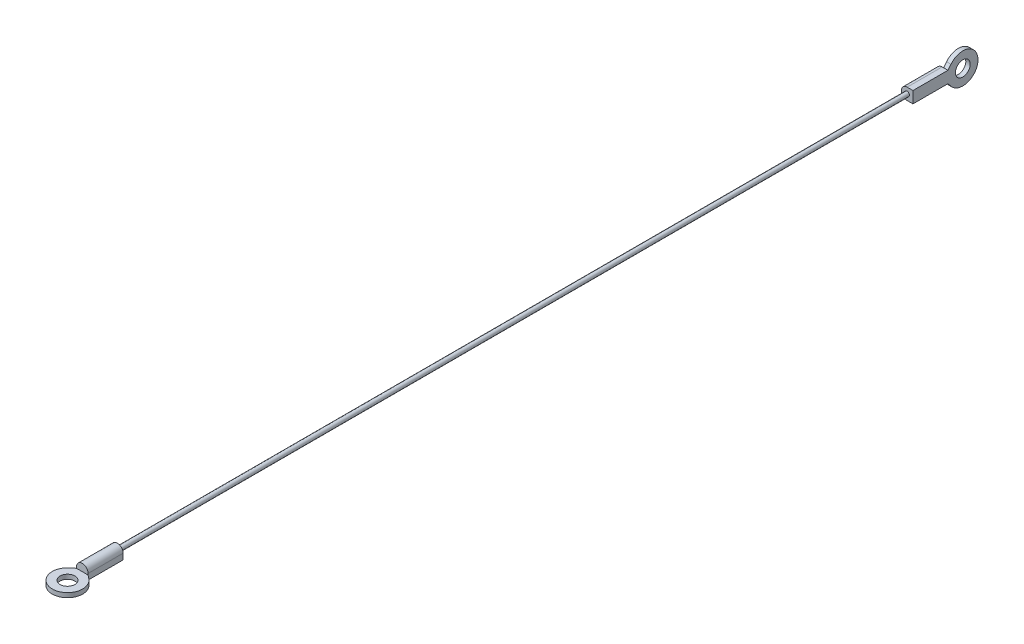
ISO-10303-21;
HEADER;
FILE_DESCRIPTION(('STEP AP214'),'2;1');
FILE_NAME('part.step','',(''),(''),'','','');
FILE_SCHEMA(('AUTOMOTIVE_DESIGN { 1 0 10303 214 1 1 1 1 }'));
ENDSEC;
DATA;
#1=APPLICATION_CONTEXT('core data for automotive mechanical design processes');
#2=APPLICATION_PROTOCOL_DEFINITION('international standard','automotive_design',2000,#1);
#3=PRODUCT_CONTEXT('',#1,'mechanical');
#4=PRODUCT('Part','Part','',(#3));
#5=PRODUCT_RELATED_PRODUCT_CATEGORY('part','',(#4));
#6=PRODUCT_DEFINITION_FORMATION('','',#4);
#7=PRODUCT_DEFINITION_CONTEXT('part definition',#1,'design');
#8=PRODUCT_DEFINITION('design','',#6,#7);
#9=PRODUCT_DEFINITION_SHAPE('','',#8);
#10=(LENGTH_UNIT() NAMED_UNIT(*) SI_UNIT(.MILLI.,.METRE.));
#11=(NAMED_UNIT(*) PLANE_ANGLE_UNIT() SI_UNIT($,.RADIAN.));
#12=(NAMED_UNIT(*) SI_UNIT($,.STERADIAN.) SOLID_ANGLE_UNIT());
#13=UNCERTAINTY_MEASURE_WITH_UNIT(LENGTH_MEASURE(1.E-05),#10,'distance_accuracy_value','');
#14=(GEOMETRIC_REPRESENTATION_CONTEXT(3) GLOBAL_UNCERTAINTY_ASSIGNED_CONTEXT((#13)) GLOBAL_UNIT_ASSIGNED_CONTEXT((#10,
#11,#12)) REPRESENTATION_CONTEXT('',''));
#15=CARTESIAN_POINT('',(0.,0.,0.));
#16=DIRECTION('',(0.,0.,1.));
#17=DIRECTION('',(1.,0.,0.));
#18=AXIS2_PLACEMENT_3D('',#15,#16,#17);
#19=CARTESIAN_POINT('',(0.,0.,-147.32));
#20=DIRECTION('',(0.,0.,-1.));
#21=DIRECTION('',(-1.,0.,0.));
#22=AXIS2_PLACEMENT_3D('',#19,#20,#21);
#23=PLANE('',#22);
#24=DIRECTION('',(1.,0.,0.));
#25=VECTOR('',#24,1.);
#26=CARTESIAN_POINT('',(0.,1.99,-147.32));
#27=LINE('',#26,#25);
#28=CARTESIAN_POINT('',(0.,1.99,-147.32));
#29=VERTEX_POINT('',#28);
#30=CARTESIAN_POINT('',(0.47,1.99,-147.32));
#31=VERTEX_POINT('',#30);
#32=EDGE_CURVE('E196',#29,#31,#27,.T.);
#33=ORIENTED_EDGE('',*,*,#32,.T.);
#34=DIRECTION('',(0.,-1.,0.));
#35=VECTOR('',#34,1.);
#36=CARTESIAN_POINT('',(0.47,-1.99,-147.32));
#37=LINE('',#36,#35);
#38=CARTESIAN_POINT('',(0.47,-1.99,-147.32));
#39=VERTEX_POINT('',#38);
#40=EDGE_CURVE('E154',#31,#39,#37,.T.);
#41=ORIENTED_EDGE('',*,*,#40,.T.);
#42=DIRECTION('',(-1.,0.,0.));
#43=VECTOR('',#42,1.);
#44=CARTESIAN_POINT('',(1.99,-1.99,-147.32));
#45=LINE('',#44,#43);
#46=CARTESIAN_POINT('',(0.,-1.99,-147.32));
#47=VERTEX_POINT('',#46);
#48=EDGE_CURVE('E201',#39,#47,#45,.T.);
#49=ORIENTED_EDGE('',*,*,#48,.T.);
#50=CARTESIAN_POINT('',(0.,0.,-147.32));
#51=DIRECTION('',(0.,0.,-1.));
#52=DIRECTION('',(-1.,0.,0.));
#53=AXIS2_PLACEMENT_3D('',#50,#51,#52);
#54=CIRCLE('',#53,1.99);
#55=EDGE_CURVE('E192',#47,#29,#54,.T.);
#56=ORIENTED_EDGE('',*,*,#55,.T.);
#57=EDGE_LOOP('',(#33,#41,#49,#56));
#58=FACE_BOUND('',#57,.T.);
#59=ADVANCED_FACE('F39',(#58),#23,.T.);
#60=CARTESIAN_POINT('',(0.,0.,147.32));
#61=DIRECTION('',(0.,0.,1.));
#62=DIRECTION('',(1.,0.,0.));
#63=AXIS2_PLACEMENT_3D('',#60,#61,#62);
#64=PLANE('',#63);
#65=DIRECTION('',(0.,-1.,0.));
#66=VECTOR('',#65,1.);
#67=CARTESIAN_POINT('',(-1.99,0.,147.32));
#68=LINE('',#67,#66);
#69=CARTESIAN_POINT('',(-1.99,0.,147.32));
#70=VERTEX_POINT('',#69);
#71=CARTESIAN_POINT('',(-1.99,-0.47,147.32));
#72=VERTEX_POINT('',#71);
#73=EDGE_CURVE('E280',#70,#72,#68,.T.);
#74=ORIENTED_EDGE('',*,*,#73,.T.);
#75=DIRECTION('',(1.,0.,0.));
#76=VECTOR('',#75,1.);
#77=CARTESIAN_POINT('',(-1.99,-0.47,147.32));
#78=LINE('',#77,#76);
#79=CARTESIAN_POINT('',(1.99,-0.47,147.32));
#80=VERTEX_POINT('',#79);
#81=EDGE_CURVE('E241',#72,#80,#78,.T.);
#82=ORIENTED_EDGE('',*,*,#81,.T.);
#83=DIRECTION('',(0.,1.,0.));
#84=VECTOR('',#83,1.);
#85=CARTESIAN_POINT('',(1.99,-1.99,147.32));
#86=LINE('',#85,#84);
#87=CARTESIAN_POINT('',(1.99,0.,147.32));
#88=VERTEX_POINT('',#87);
#89=EDGE_CURVE('E285',#80,#88,#86,.T.);
#90=ORIENTED_EDGE('',*,*,#89,.T.);
#91=CARTESIAN_POINT('',(0.,0.,147.32));
#92=DIRECTION('',(0.,0.,1.));
#93=DIRECTION('',(1.,0.,0.));
#94=AXIS2_PLACEMENT_3D('',#91,#92,#93);
#95=CIRCLE('',#94,1.99);
#96=EDGE_CURVE('E276',#88,#70,#95,.T.);
#97=ORIENTED_EDGE('',*,*,#96,.T.);
#98=EDGE_LOOP('',(#74,#82,#90,#97));
#99=FACE_BOUND('',#98,.T.);
#100=ADVANCED_FACE('F338',(#99),#64,.T.);
#101=CARTESIAN_POINT('',(0.,0.,135.32));
#102=DIRECTION('',(0.,0.,-1.));
#103=DIRECTION('',(-1.,0.,0.));
#104=AXIS2_PLACEMENT_3D('',#101,#102,#103);
#105=CYLINDRICAL_SURFACE('',#104,0.795);
#106=CARTESIAN_POINT('',(0.,0.,135.32));
#107=DIRECTION('',(0.,0.,1.));
#108=DIRECTION('',(1.,0.,0.));
#109=AXIS2_PLACEMENT_3D('',#106,#107,#108);
#110=CIRCLE('',#109,0.795);
#111=CARTESIAN_POINT('',(0.795,0.,135.32));
#112=VERTEX_POINT('',#111);
#113=EDGE_CURVE('E11',#112,#112,#110,.T.);
#114=ORIENTED_EDGE('',*,*,#113,.F.);
#115=EDGE_LOOP('',(#114));
#116=FACE_BOUND('',#115,.T.);
#117=CARTESIAN_POINT('',(0.,0.,-135.32));
#118=DIRECTION('',(0.,0.,1.));
#119=DIRECTION('',(1.,0.,0.));
#120=AXIS2_PLACEMENT_3D('',#117,#118,#119);
#121=CIRCLE('',#120,0.795);
#122=CARTESIAN_POINT('',(0.795,0.,-135.32));
#123=VERTEX_POINT('',#122);
#124=EDGE_CURVE('E43',#123,#123,#121,.T.);
#125=ORIENTED_EDGE('',*,*,#124,.T.);
#126=EDGE_LOOP('',(#125));
#127=FACE_BOUND('',#126,.T.);
#128=ADVANCED_FACE('F41',(#116,#127),#105,.T.);
#129=CARTESIAN_POINT('',(0.,0.,147.32));
#130=DIRECTION('',(0.,0.,-1.));
#131=DIRECTION('',(-1.,0.,0.));
#132=AXIS2_PLACEMENT_3D('',#129,#130,#131);
#133=CYLINDRICAL_SURFACE('',#132,1.99);
#134=CARTESIAN_POINT('',(0.,0.,135.32));
#135=DIRECTION('',(0.,0.,1.));
#136=DIRECTION('',(1.,0.,0.));
#137=AXIS2_PLACEMENT_3D('',#134,#135,#136);
#138=CIRCLE('',#137,1.99);
#139=CARTESIAN_POINT('',(1.99,0.,135.32));
#140=VERTEX_POINT('',#139);
#141=CARTESIAN_POINT('',(-1.99,0.,135.32));
#142=VERTEX_POINT('',#141);
#143=EDGE_CURVE('E270',#140,#142,#138,.T.);
#144=ORIENTED_EDGE('',*,*,#143,.T.);
#145=DIRECTION('',(0.,0.,-1.));
#146=VECTOR('',#145,1.);
#147=CARTESIAN_POINT('',(-1.99,0.,147.32));
#148=LINE('',#147,#146);
#149=EDGE_CURVE('E49',#70,#142,#148,.T.);
#150=ORIENTED_EDGE('',*,*,#149,.F.);
#151=ORIENTED_EDGE('',*,*,#96,.F.);
#152=DIRECTION('',(0.,0.,-1.));
#153=VECTOR('',#152,1.);
#154=CARTESIAN_POINT('',(1.99,0.,147.32));
#155=LINE('',#154,#153);
#156=EDGE_CURVE('E289',#88,#140,#155,.T.);
#157=ORIENTED_EDGE('',*,*,#156,.T.);
#158=EDGE_LOOP('',(#144,#150,#151,#157));
#159=FACE_BOUND('',#158,.T.);
#160=ADVANCED_FACE('F322',(#159),#133,.T.);
#161=CARTESIAN_POINT('',(-1.99,0.,147.32));
#162=DIRECTION('',(1.,0.,0.));
#163=DIRECTION('',(0.,1.,0.));
#164=AXIS2_PLACEMENT_3D('',#161,#162,#163);
#165=PLANE('',#164);
#166=DIRECTION('',(0.,-1.,0.));
#167=VECTOR('',#166,1.);
#168=CARTESIAN_POINT('',(-1.99,0.,135.32));
#169=LINE('',#168,#167);
#170=CARTESIAN_POINT('',(-1.99,-1.99,135.32));
#171=VERTEX_POINT('',#170);
#172=EDGE_CURVE('E293',#142,#171,#169,.T.);
#173=ORIENTED_EDGE('',*,*,#172,.T.);
#174=DIRECTION('',(0.,0.,-1.));
#175=VECTOR('',#174,1.);
#176=CARTESIAN_POINT('',(-1.99,-1.99,147.32));
#177=LINE('',#176,#175);
#178=CARTESIAN_POINT('',(-1.99,-1.99,147.32));
#179=VERTEX_POINT('',#178);
#180=EDGE_CURVE('E308',#179,#171,#177,.T.);
#181=ORIENTED_EDGE('',*,*,#180,.F.);
#182=DIRECTION('',(0.,-1.,0.));
#183=VECTOR('',#182,1.);
#184=CARTESIAN_POINT('',(-1.99,-0.47,147.32));
#185=LINE('',#184,#183);
#186=EDGE_CURVE('E267',#72,#179,#185,.T.);
#187=ORIENTED_EDGE('',*,*,#186,.F.);
#188=ORIENTED_EDGE('',*,*,#73,.F.);
#189=ORIENTED_EDGE('',*,*,#149,.T.);
#190=EDGE_LOOP('',(#173,#181,#187,#188,#189));
#191=FACE_BOUND('',#190,.T.);
#192=ADVANCED_FACE('F316',(#191),#165,.F.);
#193=CARTESIAN_POINT('',(0.,-1.99,147.32));
#194=DIRECTION('',(0.,1.,0.));
#195=DIRECTION('',(0.,0.,1.));
#196=AXIS2_PLACEMENT_3D('',#193,#194,#195);
#197=PLANE('',#196);
#198=DIRECTION('',(1.,0.,0.));
#199=VECTOR('',#198,1.);
#200=CARTESIAN_POINT('',(0.,-1.99,135.32));
#201=LINE('',#200,#199);
#202=CARTESIAN_POINT('',(1.99,-1.99,135.32));
#203=VERTEX_POINT('',#202);
#204=EDGE_CURVE('E297',#171,#203,#201,.T.);
#205=ORIENTED_EDGE('',*,*,#204,.T.);
#206=DIRECTION('',(0.,0.,-1.));
#207=VECTOR('',#206,1.);
#208=CARTESIAN_POINT('',(1.99,-1.99,147.32));
#209=LINE('',#208,#207);
#210=CARTESIAN_POINT('',(1.99,-1.99,147.32));
#211=VERTEX_POINT('',#210);
#212=EDGE_CURVE('E304',#211,#203,#209,.T.);
#213=ORIENTED_EDGE('',*,*,#212,.F.);
#214=DIRECTION('',(0.778962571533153,0.,0.627070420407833));
#215=VECTOR('',#214,1.);
#216=CARTESIAN_POINT('',(1.99,-1.99,147.32));
#217=LINE('',#216,#215);
#218=CARTESIAN_POINT('',(3.26390153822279,-1.99,148.34549981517));
#219=VERTEX_POINT('',#218);
#220=EDGE_CURVE('E236',#211,#219,#217,.T.);
#221=ORIENTED_EDGE('',*,*,#220,.T.);
#222=CARTESIAN_POINT('',(0.,-1.99,152.4));
#223=DIRECTION('',(0.,-1.,0.));
#224=DIRECTION('',(0.,0.,-1.));
#225=AXIS2_PLACEMENT_3D('',#222,#223,#224);
#226=CIRCLE('',#225,5.20500000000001);
#227=CARTESIAN_POINT('',(-3.2639015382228,-1.99,148.34549981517));
#228=VERTEX_POINT('',#227);
#229=EDGE_CURVE('E260',#219,#228,#226,.T.);
#230=ORIENTED_EDGE('',*,*,#229,.T.);
#231=DIRECTION('',(0.778962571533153,0.,-0.627070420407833));
#232=VECTOR('',#231,1.);
#233=CARTESIAN_POINT('',(-3.26390153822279,-1.99,148.34549981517));
#234=LINE('',#233,#232);
#235=EDGE_CURVE('E245',#228,#179,#234,.T.);
#236=ORIENTED_EDGE('',*,*,#235,.T.);
#237=ORIENTED_EDGE('',*,*,#180,.T.);
#238=EDGE_LOOP('',(#205,#213,#221,#230,#236,#237));
#239=FACE_BOUND('',#238,.T.);
#240=CARTESIAN_POINT('',(0.,-1.99,152.4));
#241=DIRECTION('',(0.,-1.,0.));
#242=DIRECTION('',(0.,0.,-1.));
#243=AXIS2_PLACEMENT_3D('',#240,#241,#242);
#244=CIRCLE('',#243,2.54);
#245=CARTESIAN_POINT('',(0.,-1.99,149.86));
#246=VERTEX_POINT('',#245);
#247=EDGE_CURVE('E237',#246,#246,#244,.T.);
#248=ORIENTED_EDGE('',*,*,#247,.F.);
#249=EDGE_LOOP('',(#248));
#250=FACE_BOUND('',#249,.T.);
#251=ADVANCED_FACE('F329',(#239,#250),#197,.F.);
#252=CARTESIAN_POINT('',(1.99,-1.99,147.32));
#253=DIRECTION('',(-1.,0.,0.));
#254=DIRECTION('',(0.,-1.,0.));
#255=AXIS2_PLACEMENT_3D('',#252,#253,#254);
#256=PLANE('',#255);
#257=DIRECTION('',(0.,1.,0.));
#258=VECTOR('',#257,1.);
#259=CARTESIAN_POINT('',(1.99,-1.99,135.32));
#260=LINE('',#259,#258);
#261=EDGE_CURVE('E281',#203,#140,#260,.T.);
#262=ORIENTED_EDGE('',*,*,#261,.T.);
#263=ORIENTED_EDGE('',*,*,#156,.F.);
#264=ORIENTED_EDGE('',*,*,#89,.F.);
#265=EDGE_CURVE('E286',#211,#80,#86,.T.);
#266=ORIENTED_EDGE('',*,*,#265,.F.);
#267=ORIENTED_EDGE('',*,*,#212,.T.);
#268=EDGE_LOOP('',(#262,#263,#264,#266,#267));
#269=FACE_BOUND('',#268,.T.);
#270=ADVANCED_FACE('F333',(#269),#256,.F.);
#271=CARTESIAN_POINT('',(0.,0.,135.32));
#272=DIRECTION('',(0.,0.,1.));
#273=DIRECTION('',(1.,0.,0.));
#274=AXIS2_PLACEMENT_3D('',#271,#272,#273);
#275=PLANE('',#274);
#276=ORIENTED_EDGE('',*,*,#113,.T.);
#277=EDGE_LOOP('',(#276));
#278=FACE_BOUND('',#277,.T.);
#279=ORIENTED_EDGE('',*,*,#143,.F.);
#280=ORIENTED_EDGE('',*,*,#261,.F.);
#281=ORIENTED_EDGE('',*,*,#204,.F.);
#282=ORIENTED_EDGE('',*,*,#172,.F.);
#283=EDGE_LOOP('',(#279,#280,#281,#282));
#284=FACE_BOUND('',#283,.T.);
#285=ADVANCED_FACE('F326',(#278,#284),#275,.F.);
#286=CARTESIAN_POINT('',(-3.26390153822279,-0.47,148.34549981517));
#287=DIRECTION('',(-0.627070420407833,0.,-0.778962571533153));
#288=DIRECTION('',(-0.778962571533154,0.,0.627070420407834));
#289=AXIS2_PLACEMENT_3D('',#286,#287,#288);
#290=PLANE('',#289);
#291=ORIENTED_EDGE('',*,*,#235,.F.);
#292=DIRECTION('',(0.,-1.,0.));
#293=VECTOR('',#292,1.);
#294=CARTESIAN_POINT('',(-3.2639015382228,-0.47,148.34549981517));
#295=LINE('',#294,#293);
#296=CARTESIAN_POINT('',(-3.2639015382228,-0.47,148.34549981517));
#297=VERTEX_POINT('',#296);
#298=EDGE_CURVE('E271',#297,#228,#295,.T.);
#299=ORIENTED_EDGE('',*,*,#298,.F.);
#300=DIRECTION('',(0.778962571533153,0.,-0.627070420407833));
#301=VECTOR('',#300,1.);
#302=CARTESIAN_POINT('',(-3.26390153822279,-0.47,148.34549981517));
#303=LINE('',#302,#301);
#304=EDGE_CURVE('E252',#297,#72,#303,.T.);
#305=ORIENTED_EDGE('',*,*,#304,.T.);
#306=ORIENTED_EDGE('',*,*,#186,.T.);
#307=EDGE_LOOP('',(#291,#299,#305,#306));
#308=FACE_BOUND('',#307,.T.);
#309=ADVANCED_FACE('F343',(#308),#290,.T.);
#310=CARTESIAN_POINT('',(0.,-0.47,152.4));
#311=DIRECTION('',(0.,-1.,0.));
#312=DIRECTION('',(0.,0.,-1.));
#313=AXIS2_PLACEMENT_3D('',#310,#311,#312);
#314=CYLINDRICAL_SURFACE('',#313,5.20500000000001);
#315=ORIENTED_EDGE('',*,*,#229,.F.);
#316=DIRECTION('',(0.,-1.,0.));
#317=VECTOR('',#316,1.);
#318=CARTESIAN_POINT('',(3.26390153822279,-0.47,148.34549981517));
#319=LINE('',#318,#317);
#320=CARTESIAN_POINT('',(3.26390153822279,-0.47,148.34549981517));
#321=VERTEX_POINT('',#320);
#322=EDGE_CURVE('E256',#321,#219,#319,.T.);
#323=ORIENTED_EDGE('',*,*,#322,.F.);
#324=CARTESIAN_POINT('',(0.,-0.47,152.4));
#325=DIRECTION('',(0.,-1.,0.));
#326=DIRECTION('',(0.,0.,-1.));
#327=AXIS2_PLACEMENT_3D('',#324,#325,#326);
#328=CIRCLE('',#327,5.20500000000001);
#329=EDGE_CURVE('E248',#321,#297,#328,.T.);
#330=ORIENTED_EDGE('',*,*,#329,.T.);
#331=ORIENTED_EDGE('',*,*,#298,.T.);
#332=EDGE_LOOP('',(#315,#323,#330,#331));
#333=FACE_BOUND('',#332,.T.);
#334=ADVANCED_FACE('F346',(#333),#314,.T.);
#335=CARTESIAN_POINT('',(1.99,-0.47,147.32));
#336=DIRECTION('',(0.627070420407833,0.,-0.778962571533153));
#337=DIRECTION('',(-0.778962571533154,0.,-0.627070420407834));
#338=AXIS2_PLACEMENT_3D('',#335,#336,#337);
#339=PLANE('',#338);
#340=ORIENTED_EDGE('',*,*,#220,.F.);
#341=ORIENTED_EDGE('',*,*,#265,.T.);
#342=DIRECTION('',(0.778962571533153,0.,0.627070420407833));
#343=VECTOR('',#342,1.);
#344=CARTESIAN_POINT('',(1.99,-0.47,147.32));
#345=LINE('',#344,#343);
#346=EDGE_CURVE('E64',#80,#321,#345,.T.);
#347=ORIENTED_EDGE('',*,*,#346,.T.);
#348=ORIENTED_EDGE('',*,*,#322,.T.);
#349=EDGE_LOOP('',(#340,#341,#347,#348));
#350=FACE_BOUND('',#349,.T.);
#351=ADVANCED_FACE('F336',(#350),#339,.T.);
#352=CARTESIAN_POINT('',(0.,-0.47,152.4));
#353=DIRECTION('',(0.,-1.,0.));
#354=DIRECTION('',(0.,0.,-1.));
#355=AXIS2_PLACEMENT_3D('',#352,#353,#354);
#356=PLANE('',#355);
#357=CARTESIAN_POINT('',(0.,-0.47,152.4));
#358=DIRECTION('',(0.,-1.,0.));
#359=DIRECTION('',(0.,0.,-1.));
#360=AXIS2_PLACEMENT_3D('',#357,#358,#359);
#361=CIRCLE('',#360,2.54);
#362=CARTESIAN_POINT('',(0.,-0.47,149.86));
#363=VERTEX_POINT('',#362);
#364=EDGE_CURVE('E232',#363,#363,#361,.T.);
#365=ORIENTED_EDGE('',*,*,#364,.T.);
#366=EDGE_LOOP('',(#365));
#367=FACE_BOUND('',#366,.T.);
#368=ORIENTED_EDGE('',*,*,#81,.F.);
#369=ORIENTED_EDGE('',*,*,#304,.F.);
#370=ORIENTED_EDGE('',*,*,#329,.F.);
#371=ORIENTED_EDGE('',*,*,#346,.F.);
#372=EDGE_LOOP('',(#368,#369,#370,#371));
#373=FACE_BOUND('',#372,.T.);
#374=ADVANCED_FACE('F340',(#367,#373),#356,.F.);
#375=CARTESIAN_POINT('',(0.,-0.47,152.4));
#376=DIRECTION('',(0.,-1.,0.));
#377=DIRECTION('',(0.,0.,-1.));
#378=AXIS2_PLACEMENT_3D('',#375,#376,#377);
#379=CYLINDRICAL_SURFACE('',#378,2.54);
#380=ORIENTED_EDGE('',*,*,#364,.F.);
#381=EDGE_LOOP('',(#380));
#382=FACE_BOUND('',#381,.T.);
#383=ORIENTED_EDGE('',*,*,#247,.T.);
#384=EDGE_LOOP('',(#383));
#385=FACE_BOUND('',#384,.T.);
#386=ADVANCED_FACE('F384',(#382,#385),#379,.F.);
#387=CARTESIAN_POINT('',(0.,0.,-147.32));
#388=DIRECTION('',(0.,0.,1.));
#389=DIRECTION('',(1.,0.,0.));
#390=AXIS2_PLACEMENT_3D('',#387,#388,#389);
#391=CYLINDRICAL_SURFACE('',#390,1.99);
#392=CARTESIAN_POINT('',(0.,0.,-135.32));
#393=DIRECTION('',(0.,0.,-1.));
#394=DIRECTION('',(-1.,0.,0.));
#395=AXIS2_PLACEMENT_3D('',#392,#393,#394);
#396=CIRCLE('',#395,1.99);
#397=CARTESIAN_POINT('',(0.,-1.99,-135.32));
#398=VERTEX_POINT('',#397);
#399=CARTESIAN_POINT('',(0.,1.99,-135.32));
#400=VERTEX_POINT('',#399);
#401=EDGE_CURVE('E189',#398,#400,#396,.T.);
#402=ORIENTED_EDGE('',*,*,#401,.T.);
#403=DIRECTION('',(0.,0.,1.));
#404=VECTOR('',#403,1.);
#405=CARTESIAN_POINT('',(0.,1.99,-147.32));
#406=LINE('',#405,#404);
#407=EDGE_CURVE('E228',#29,#400,#406,.T.);
#408=ORIENTED_EDGE('',*,*,#407,.F.);
#409=ORIENTED_EDGE('',*,*,#55,.F.);
#410=DIRECTION('',(0.,0.,1.));
#411=VECTOR('',#410,1.);
#412=CARTESIAN_POINT('',(0.,-1.99,-147.32));
#413=LINE('',#412,#411);
#414=EDGE_CURVE('E204',#47,#398,#413,.T.);
#415=ORIENTED_EDGE('',*,*,#414,.T.);
#416=EDGE_LOOP('',(#402,#408,#409,#415));
#417=FACE_BOUND('',#416,.T.);
#418=ADVANCED_FACE('F380',(#417),#391,.T.);
#419=CARTESIAN_POINT('',(0.,1.99,-147.32));
#420=DIRECTION('',(0.,-1.,0.));
#421=DIRECTION('',(0.,0.,-1.));
#422=AXIS2_PLACEMENT_3D('',#419,#420,#421);
#423=PLANE('',#422);
#424=DIRECTION('',(1.,0.,0.));
#425=VECTOR('',#424,1.);
#426=CARTESIAN_POINT('',(0.,1.99,-135.32));
#427=LINE('',#426,#425);
#428=CARTESIAN_POINT('',(1.99,1.99,-135.32));
#429=VERTEX_POINT('',#428);
#430=EDGE_CURVE('E208',#400,#429,#427,.T.);
#431=ORIENTED_EDGE('',*,*,#430,.T.);
#432=DIRECTION('',(0.,0.,1.));
#433=VECTOR('',#432,1.);
#434=CARTESIAN_POINT('',(1.99,1.99,-147.32));
#435=LINE('',#434,#433);
#436=CARTESIAN_POINT('',(1.99,1.99,-147.32));
#437=VERTEX_POINT('',#436);
#438=EDGE_CURVE('E224',#437,#429,#435,.T.);
#439=ORIENTED_EDGE('',*,*,#438,.F.);
#440=DIRECTION('',(1.,0.,0.));
#441=VECTOR('',#440,1.);
#442=CARTESIAN_POINT('',(0.47,1.99,-147.32));
#443=LINE('',#442,#441);
#444=EDGE_CURVE('E186',#31,#437,#443,.T.);
#445=ORIENTED_EDGE('',*,*,#444,.F.);
#446=ORIENTED_EDGE('',*,*,#32,.F.);
#447=ORIENTED_EDGE('',*,*,#407,.T.);
#448=EDGE_LOOP('',(#431,#439,#445,#446,#447));
#449=FACE_BOUND('',#448,.T.);
#450=ADVANCED_FACE('F376',(#449),#423,.F.);
#451=CARTESIAN_POINT('',(1.99,0.,-147.32));
#452=DIRECTION('',(-1.,0.,0.));
#453=DIRECTION('',(0.,-1.,0.));
#454=AXIS2_PLACEMENT_3D('',#451,#452,#453);
#455=PLANE('',#454);
#456=DIRECTION('',(0.,-1.,0.));
#457=VECTOR('',#456,1.);
#458=CARTESIAN_POINT('',(1.99,0.,-135.32));
#459=LINE('',#458,#457);
#460=CARTESIAN_POINT('',(1.99,-1.99,-135.32));
#461=VERTEX_POINT('',#460);
#462=EDGE_CURVE('E212',#429,#461,#459,.T.);
#463=ORIENTED_EDGE('',*,*,#462,.T.);
#464=DIRECTION('',(0.,0.,1.));
#465=VECTOR('',#464,1.);
#466=CARTESIAN_POINT('',(1.99,-1.99,-147.32));
#467=LINE('',#466,#465);
#468=CARTESIAN_POINT('',(1.99,-1.99,-147.32));
#469=VERTEX_POINT('',#468);
#470=EDGE_CURVE('E220',#469,#461,#467,.T.);
#471=ORIENTED_EDGE('',*,*,#470,.F.);
#472=DIRECTION('',(0.,-0.778962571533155,-0.627070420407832));
#473=VECTOR('',#472,1.);
#474=CARTESIAN_POINT('',(1.99,-3.2639015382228,-148.34549981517));
#475=LINE('',#474,#473);
#476=CARTESIAN_POINT('',(1.99,-3.2639015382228,-148.34549981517));
#477=VERTEX_POINT('',#476);
#478=EDGE_CURVE('E180',#469,#477,#475,.T.);
#479=ORIENTED_EDGE('',*,*,#478,.T.);
#480=CARTESIAN_POINT('',(1.99,0.,-152.4));
#481=DIRECTION('',(1.,0.,0.));
#482=DIRECTION('',(0.,0.,1.));
#483=AXIS2_PLACEMENT_3D('',#480,#481,#482);
#484=CIRCLE('',#483,5.20500000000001);
#485=CARTESIAN_POINT('',(1.99,3.2639015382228,-148.34549981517));
#486=VERTEX_POINT('',#485);
#487=EDGE_CURVE('E149',#477,#486,#484,.T.);
#488=ORIENTED_EDGE('',*,*,#487,.T.);
#489=DIRECTION('',(0.,-0.778962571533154,0.627070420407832));
#490=VECTOR('',#489,1.);
#491=CARTESIAN_POINT('',(1.99,1.99,-147.32));
#492=LINE('',#491,#490);
#493=EDGE_CURVE('E166',#486,#437,#492,.T.);
#494=ORIENTED_EDGE('',*,*,#493,.T.);
#495=ORIENTED_EDGE('',*,*,#438,.T.);
#496=EDGE_LOOP('',(#463,#471,#479,#488,#494,#495));
#497=FACE_BOUND('',#496,.T.);
#498=CARTESIAN_POINT('',(1.99,0.,-152.4));
#499=DIRECTION('',(1.,0.,0.));
#500=DIRECTION('',(0.,0.,-1.));
#501=AXIS2_PLACEMENT_3D('',#498,#499,#500);
#502=CIRCLE('',#501,2.53999999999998);
#503=CARTESIAN_POINT('',(1.99,0.,-154.94));
#504=VERTEX_POINT('',#503);
#505=EDGE_CURVE('E173',#504,#504,#502,.T.);
#506=ORIENTED_EDGE('',*,*,#505,.F.);
#507=EDGE_LOOP('',(#506));
#508=FACE_BOUND('',#507,.T.);
#509=ADVANCED_FACE('F372',(#497,#508),#455,.F.);
#510=CARTESIAN_POINT('',(1.99,-1.99,-147.32));
#511=DIRECTION('',(0.,1.,0.));
#512=DIRECTION('',(0.,0.,1.));
#513=AXIS2_PLACEMENT_3D('',#510,#511,#512);
#514=PLANE('',#513);
#515=DIRECTION('',(-1.,0.,0.));
#516=VECTOR('',#515,1.);
#517=CARTESIAN_POINT('',(1.99,-1.99,-135.32));
#518=LINE('',#517,#516);
#519=EDGE_CURVE('E197',#461,#398,#518,.T.);
#520=ORIENTED_EDGE('',*,*,#519,.T.);
#521=ORIENTED_EDGE('',*,*,#414,.F.);
#522=ORIENTED_EDGE('',*,*,#48,.F.);
#523=EDGE_CURVE('E163',#469,#39,#45,.T.);
#524=ORIENTED_EDGE('',*,*,#523,.F.);
#525=ORIENTED_EDGE('',*,*,#470,.T.);
#526=EDGE_LOOP('',(#520,#521,#522,#524,#525));
#527=FACE_BOUND('',#526,.T.);
#528=ADVANCED_FACE('F368',(#527),#514,.F.);
#529=CARTESIAN_POINT('',(0.,0.,-135.32));
#530=DIRECTION('',(0.,0.,-1.));
#531=DIRECTION('',(-1.,0.,0.));
#532=AXIS2_PLACEMENT_3D('',#529,#530,#531);
#533=PLANE('',#532);
#534=ORIENTED_EDGE('',*,*,#124,.F.);
#535=EDGE_LOOP('',(#534));
#536=FACE_BOUND('',#535,.T.);
#537=ORIENTED_EDGE('',*,*,#401,.F.);
#538=ORIENTED_EDGE('',*,*,#519,.F.);
#539=ORIENTED_EDGE('',*,*,#462,.F.);
#540=ORIENTED_EDGE('',*,*,#430,.F.);
#541=EDGE_LOOP('',(#537,#538,#539,#540));
#542=FACE_BOUND('',#541,.T.);
#543=ADVANCED_FACE('F365',(#536,#542),#533,.F.);
#544=CARTESIAN_POINT('',(0.47,-3.2639015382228,-148.34549981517));
#545=DIRECTION('',(0.,-0.627070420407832,0.778962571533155));
#546=DIRECTION('',(0.,-0.778962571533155,-0.627070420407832));
#547=AXIS2_PLACEMENT_3D('',#544,#545,#546);
#548=PLANE('',#547);
#549=ORIENTED_EDGE('',*,*,#478,.F.);
#550=ORIENTED_EDGE('',*,*,#523,.T.);
#551=DIRECTION('',(0.,-0.778962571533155,-0.627070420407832));
#552=VECTOR('',#551,1.);
#553=CARTESIAN_POINT('',(0.47,-3.2639015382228,-148.34549981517));
#554=LINE('',#553,#552);
#555=CARTESIAN_POINT('',(0.47,-3.2639015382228,-148.34549981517));
#556=VERTEX_POINT('',#555);
#557=EDGE_CURVE('E56',#39,#556,#554,.T.);
#558=ORIENTED_EDGE('',*,*,#557,.T.);
#559=DIRECTION('',(1.,0.,0.));
#560=VECTOR('',#559,1.);
#561=CARTESIAN_POINT('',(0.47,-3.2639015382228,-148.34549981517));
#562=LINE('',#561,#560);
#563=EDGE_CURVE('E145',#556,#477,#562,.T.);
#564=ORIENTED_EDGE('',*,*,#563,.T.);
#565=EDGE_LOOP('',(#549,#550,#558,#564));
#566=FACE_BOUND('',#565,.T.);
#567=ADVANCED_FACE('F161',(#566),#548,.T.);
#568=CARTESIAN_POINT('',(0.47,1.99,-147.32));
#569=DIRECTION('',(0.,0.627070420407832,0.778962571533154));
#570=DIRECTION('',(0.,-0.778962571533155,0.627070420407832));
#571=AXIS2_PLACEMENT_3D('',#568,#569,#570);
#572=PLANE('',#571);
#573=ORIENTED_EDGE('',*,*,#493,.F.);
#574=DIRECTION('',(1.,0.,0.));
#575=VECTOR('',#574,1.);
#576=CARTESIAN_POINT('',(0.47,3.2639015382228,-148.34549981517));
#577=LINE('',#576,#575);
#578=CARTESIAN_POINT('',(0.47,3.2639015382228,-148.34549981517));
#579=VERTEX_POINT('',#578);
#580=EDGE_CURVE('E153',#579,#486,#577,.T.);
#581=ORIENTED_EDGE('',*,*,#580,.F.);
#582=DIRECTION('',(0.,-0.778962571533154,0.627070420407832));
#583=VECTOR('',#582,1.);
#584=CARTESIAN_POINT('',(0.47,1.99,-147.32));
#585=LINE('',#584,#583);
#586=EDGE_CURVE('E158',#579,#31,#585,.T.);
#587=ORIENTED_EDGE('',*,*,#586,.T.);
#588=ORIENTED_EDGE('',*,*,#444,.T.);
#589=EDGE_LOOP('',(#573,#581,#587,#588));
#590=FACE_BOUND('',#589,.T.);
#591=ADVANCED_FACE('F435',(#590),#572,.T.);
#592=CARTESIAN_POINT('',(0.47,0.,-152.4));
#593=DIRECTION('',(1.,0.,0.));
#594=DIRECTION('',(0.,0.,-1.));
#595=AXIS2_PLACEMENT_3D('',#592,#593,#594);
#596=CYLINDRICAL_SURFACE('',#595,5.20500000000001);
#597=ORIENTED_EDGE('',*,*,#487,.F.);
#598=ORIENTED_EDGE('',*,*,#563,.F.);
#599=CARTESIAN_POINT('',(0.47,0.,-152.4));
#600=DIRECTION('',(1.,0.,0.));
#601=DIRECTION('',(0.,0.,1.));
#602=AXIS2_PLACEMENT_3D('',#599,#600,#601);
#603=CIRCLE('',#602,5.20500000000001);
#604=EDGE_CURVE('E147',#556,#579,#603,.T.);
#605=ORIENTED_EDGE('',*,*,#604,.T.);
#606=ORIENTED_EDGE('',*,*,#580,.T.);
#607=EDGE_LOOP('',(#597,#598,#605,#606));
#608=FACE_BOUND('',#607,.T.);
#609=ADVANCED_FACE('F146',(#608),#596,.T.);
#610=CARTESIAN_POINT('',(0.47,0.,-152.4));
#611=DIRECTION('',(-1.,0.,0.));
#612=DIRECTION('',(0.,0.,1.));
#613=AXIS2_PLACEMENT_3D('',#610,#611,#612);
#614=PLANE('',#613);
#615=CARTESIAN_POINT('',(0.47,0.,-152.4));
#616=DIRECTION('',(1.,0.,0.));
#617=DIRECTION('',(0.,0.,-1.));
#618=AXIS2_PLACEMENT_3D('',#615,#616,#617);
#619=CIRCLE('',#618,2.53999999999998);
#620=CARTESIAN_POINT('',(0.47,0.,-154.94));
#621=VERTEX_POINT('',#620);
#622=EDGE_CURVE('E183',#621,#621,#619,.T.);
#623=ORIENTED_EDGE('',*,*,#622,.T.);
#624=EDGE_LOOP('',(#623));
#625=FACE_BOUND('',#624,.T.);
#626=ORIENTED_EDGE('',*,*,#557,.F.);
#627=ORIENTED_EDGE('',*,*,#40,.F.);
#628=ORIENTED_EDGE('',*,*,#586,.F.);
#629=ORIENTED_EDGE('',*,*,#604,.F.);
#630=EDGE_LOOP('',(#626,#627,#628,#629));
#631=FACE_BOUND('',#630,.T.);
#632=ADVANCED_FACE('F157',(#625,#631),#614,.T.);
#633=CARTESIAN_POINT('',(0.47,0.,-152.4));
#634=DIRECTION('',(1.,0.,0.));
#635=DIRECTION('',(0.,0.,-1.));
#636=AXIS2_PLACEMENT_3D('',#633,#634,#635);
#637=CYLINDRICAL_SURFACE('',#636,2.53999999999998);
#638=ORIENTED_EDGE('',*,*,#622,.F.);
#639=EDGE_LOOP('',(#638));
#640=FACE_BOUND('',#639,.T.);
#641=ORIENTED_EDGE('',*,*,#505,.T.);
#642=EDGE_LOOP('',(#641));
#643=FACE_BOUND('',#642,.T.);
#644=ADVANCED_FACE('F427',(#640,#643),#637,.F.);
#645=CLOSED_SHELL('',(#59,#100,#128,#160,#192,#251,#270,#285,#309,#334,#351,#374,#386,#418,#450,
#509,#528,#543,#567,#591,#609,#632,#644));
#646=MANIFOLD_SOLID_BREP('B2',#645);
#647=ADVANCED_BREP_SHAPE_REPRESENTATION('',(#18,#646),#14);
#648=SHAPE_DEFINITION_REPRESENTATION(#9,#647);
ENDSEC;
END-ISO-10303-21;
